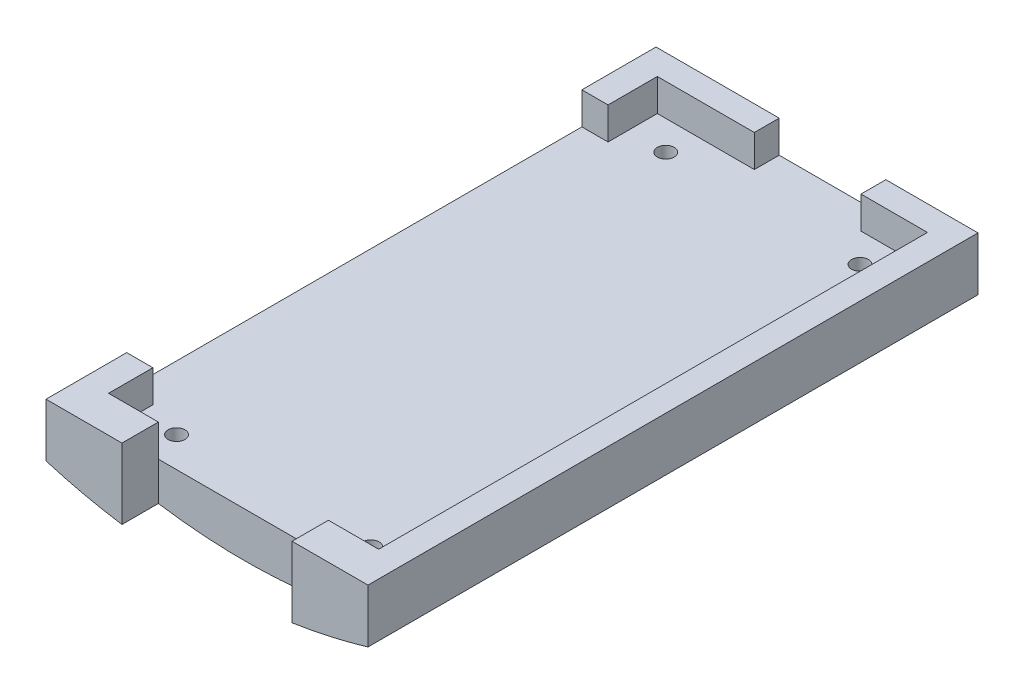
from build123d import *

# Parameters (mm, degrees)
SKETCH5_R            = 66.802
BOSS_EXTRUDE2_DEPTH  = 72.39
SKETCH6_W            = 47.755650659
SKETCH6_H            = 166.539429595
CUT_EXTRUDE2_DEPTH   = 76.2
SKETCH7_W            = 47.697642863
SKETCH7_H            = 210.531369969
CUT_EXTRUDE6_DEPTH   = 76.2
SKETCH8_W            = 84.02184285
SKETCH8_H            = 124.46
CUT_EXTRUDE7_DEPTH   = 76.2
SKETCH16_W           = 20.181173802
SKETCH16_H           = 36.504168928
CUT_EXTRUDE11_DEPTH  = 4.318
SKETCH17_W           = 32.054478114
SKETCH17_H           = 66.16676335
CUT_EXTRUDE12_DEPTH  = 3.81
SKETCH19_W           = 32.004
SKETCH19_H           = 2.032
CUT_EXTRUDE17_DEPTH  = 76.065621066
SKETCH25_W           = 12.65456728
SKETCH25_H           = 5.058539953
CUT_EXTRUDE16_DEPTH  = 3.81
SKETCH26_W           = 3.106077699
SKETCH26_H           = 54.016283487
CUT_EXTRUDE21_DEPTH  = 3.81
SKETCH32_W           = 5.965656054
SKETCH32_H           = 3.81
BOSS_EXTRUDE9_DEPTH  = 3.0776164
SKETCH33_W           = 5.907648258
SKETCH33_H           = 3.81
BOSS_EXTRUDE10_DEPTH = 3.0776164
SKETCH34_W           = 2.032
SKETCH34_H           = 3.81
CUT_EXTRUDE22_DEPTH  = 0.050478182
SKETCH41_R           = 1.143
BOSS_EXTRUDE14_DEPTH = 10.16
SKETCH42_R           = 1.143
BOSS_EXTRUDE16_DEPTH = 10.16
SKETCH43_R           = 1.143
BOSS_EXTRUDE17_DEPTH = 10.16
SKETCH44_R           = 1.143
BOSS_EXTRUDE18_DEPTH = 10.16
CUT_EXTRUDE23_DEPTH  = 4
SKETCH47_R           = 1
CUT_EXTRUDE24_DEPTH  = 76.562037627
CUT_EXTRUDE25_DEPTH  = 4
SKETCH49_R           = 1
CUT_EXTRUDE26_DEPTH  = 76.562037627
CUT_EXTRUDE27_DEPTH  = 4
CUT_EXTRUDE28_DEPTH  = 4
SKETCH53_R           = 1
CUT_EXTRUDE29_DEPTH  = 76.432145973
SKETCH54_R           = 1
CUT_EXTRUDE30_DEPTH  = 76.432145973
SKETCH55_W           = 32.054478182
SKETCH55_H           = 65.12114695
CUT_EXTRUDE31_DEPTH  = 3.81


with BuildPart() as part:
    # Sketch5 → Boss-Extrude2 (new body)
    with BuildSketch(Plane.XY):
        with Locations((0, 66.802)):
            Circle(SKETCH5_R)
    extrude(amount=BOSS_EXTRUDE2_DEPTH)

    # Sketch6 → Cut-Extrude2 (cut)
    with BuildSketch(Plane(origin=(0, 0, 0), x_dir=(-1, 0, 0), z_dir=(0, 0, -1))):
        with Locations((-42.953134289, 83.269714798)):
            Rectangle(SKETCH6_W, SKETCH6_H)
    extrude(amount=-CUT_EXTRUDE2_DEPTH, mode=Mode.SUBTRACT)

    # Sketch7 → Cut-Extrude6 (cut)
    with BuildSketch(Plane(origin=(0, 0, 0), x_dir=(-1, 0, 0), z_dir=(0, 0, -1))):
        with Locations((42.982138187, 105.265684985)):
            Rectangle(SKETCH7_W, SKETCH7_H)
    extrude(amount=-CUT_EXTRUDE6_DEPTH, mode=Mode.SUBTRACT)

    # Sketch8 → Cut-Extrude7 (cut)
    with BuildSketch(Plane(origin=(0, 0, 0), x_dir=(-1, 0, 0), z_dir=(0, 0, -1))):
        with Locations((9.699409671, 71.374)):
            Rectangle(SKETCH8_W, SKETCH8_H)
    extrude(amount=-CUT_EXTRUDE7_DEPTH, mode=Mode.SUBTRACT)

    # Sketch16 → Cut-Extrude11 (cut)
    with BuildSketch(Plane.XY.offset(72.39)):
        with Locations((-0.029003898, 9.435791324)):
            Rectangle(SKETCH16_W, SKETCH16_H)
    extrude(amount=-CUT_EXTRUDE11_DEPTH, mode=Mode.SUBTRACT)

    # Sketch17 → Cut-Extrude12 (cut)
    with BuildSketch(Plane(origin=(0, 9.144, 0), x_dir=(1, 0, 0), z_dir=(0, 1, 0))):
        with Locations((0, -38.066241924)):
            Rectangle(SKETCH17_W, SKETCH17_H)
    extrude(amount=-CUT_EXTRUDE12_DEPTH, mode=Mode.SUBTRACT)

    # Sketch19 → Cut-Extrude17 (cut, through all)
    with BuildSketch(Plane(origin=(0, 5.334, 0), x_dir=(1, 0, 0), z_dir=(0, 1, 0))):
        with Locations((0.025239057, -3.966860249)):
            Rectangle(SKETCH19_W, SKETCH19_H)
    extrude(amount=CUT_EXTRUDE17_DEPTH, mode=Mode.SUBTRACT)

    # Sketch25 → Cut-Extrude16 (cut)
    with BuildSketch(Plane(origin=(0, 9.144, 0), x_dir=(1, 0, 0), z_dir=(0, 1, 0))):
        with Locations((1.812699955, -1.12851864)):
            Rectangle(SKETCH25_W, SKETCH25_H)
    extrude(amount=-CUT_EXTRUDE16_DEPTH, mode=Mode.SUBTRACT)

    # Sketch26 → Cut-Extrude21 (cut)
    with BuildSketch(Plane(origin=(0, 9.144, 0), x_dir=(1, 0, 0), z_dir=(0, 1, 0))):
        with Locations((-17.580277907, -35.806583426)):
            Rectangle(SKETCH26_W, SKETCH26_H)
    extrude(amount=-CUT_EXTRUDE21_DEPTH, mode=Mode.SUBTRACT)

    # Sketch32 → Boss-Extrude9 (add)
    with BuildSketch(Plane(origin=(0, 0, 71.149623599), x_dir=(-1, 0, 0), z_dir=(0, 0, -1))):
        with Locations((-13.04441103, 7.239)):
            Rectangle(SKETCH32_W, SKETCH32_H)
    extrude(amount=BOSS_EXTRUDE9_DEPTH)

    # Sketch33 → Boss-Extrude10 (add)
    with BuildSketch(Plane(origin=(0, 0, 71.149623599), x_dir=(-1, 0, 0), z_dir=(0, 0, -1))):
        with Locations((13.073414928, 7.239)):
            Rectangle(SKETCH33_W, SKETCH33_H)
    extrude(amount=BOSS_EXTRUDE10_DEPTH)

    # Sketch34 → Cut-Extrude22 (cut)
    with BuildSketch(Plane(origin=(-15.976760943, 0, 0), x_dir=(0, 0, -1), z_dir=(1, 0, 0))):
        with Locations((-3.966860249, 7.239)):
            Rectangle(SKETCH34_W, SKETCH34_H)
    extrude(amount=-CUT_EXTRUDE22_DEPTH, mode=Mode.SUBTRACT)

    # Sketch41 → Boss-Extrude14 (add)
    with BuildSketch(Plane(origin=(0, 9.144, 0), x_dir=(1, 0, 0), z_dir=(0, 1, 0))):
        with Locations(Location((11.49599976, -6.4258825, 0), (0, 0, 270))):
            Circle(SKETCH41_R)
    extrude(amount=-BOSS_EXTRUDE14_DEPTH)

    # Sketch42 → Boss-Extrude16 (add)
    with BuildSketch(Plane(origin=(0, 9.144, 0), x_dir=(1, 0, 0), z_dir=(0, 1, 0))):
        with Locations(Location((-11.554007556, -6.4258698, 0), (0, 0, 270))):
            Circle(SKETCH42_R)
    extrude(amount=-BOSS_EXTRUDE16_DEPTH)

    # Sketch43 → Boss-Extrude17 (add)
    with BuildSketch(Plane(origin=(0, 9.144, 0), x_dir=(1, 0, 0), z_dir=(0, 1, 0))):
        with Locations(Location((11.49599976, -64.47586038, 0), (0, 0, 270))):
            Circle(SKETCH43_R)
    extrude(amount=-BOSS_EXTRUDE17_DEPTH)

    # Sketch44 → Boss-Extrude18 (add)
    with BuildSketch(Plane(origin=(0, 9.144, 0), x_dir=(1, 0, 0), z_dir=(0, 1, 0))):
        with Locations(Location((-11.554007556, -64.47586038, 0), (0, 0, 270))):
            Circle(SKETCH44_R)
    extrude(amount=-BOSS_EXTRUDE18_DEPTH)

    # Sketch46 → Cut-Extrude23 (cut)
    with BuildSketch(Plane(origin=(0, -1.016, 0), x_dir=(-1, 0, 0), z_dir=(0, -1, 0))):
        Polygon((-11.49599976, -62.22419433), (-13.44599976, -63.350027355), (-13.44599976, -65.601693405), (-11.49599976, -66.72752643), (-9.54599976, -65.601693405), (-9.54599976, -63.350027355), align=None)
    extrude(amount=-CUT_EXTRUDE23_DEPTH, mode=Mode.SUBTRACT)

    # Sketch47 → Cut-Extrude24 (cut, through all)
    with BuildSketch(Plane(origin=(0, 9.144, 0), x_dir=(1, 0, 0), z_dir=(0, 1, 0))):
        with Locations(Location((11.49599976, -64.47586038, 0), (0, 0, 270))):
            Circle(SKETCH47_R)
    extrude(amount=-CUT_EXTRUDE24_DEPTH, mode=Mode.SUBTRACT)

    # Sketch48 → Cut-Extrude25 (cut)
    with BuildSketch(Plane.XZ.offset(1.016)):
        Polygon((-11.554007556, 62.22419433), (-9.604007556, 63.350027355), (-9.604007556, 65.601693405), (-11.554007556, 66.72752643), (-13.504007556, 65.601693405), (-13.504007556, 63.350027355), align=None)
    extrude(amount=-CUT_EXTRUDE25_DEPTH, mode=Mode.SUBTRACT)

    # Sketch49 → Cut-Extrude26 (cut, through all)
    with BuildSketch(Plane(origin=(0, 9.144, 0), x_dir=(1, 0, 0), z_dir=(0, 1, 0))):
        with Locations(Location((-11.554007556, -64.47586038, 0), (0, 0, 270))):
            Circle(SKETCH49_R)
    extrude(amount=-CUT_EXTRUDE26_DEPTH, mode=Mode.SUBTRACT)

    # Sketch50 → Cut-Extrude27 (cut)
    with BuildSketch(Plane.XZ.offset(1.016)):
        Polygon((-11.554007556, 4.17420375), (-9.604007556, 5.300036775), (-9.604007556, 7.551702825), (-11.554007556, 8.67753585), (-13.504007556, 7.551702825), (-13.504007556, 5.300036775), align=None)
    extrude(amount=-CUT_EXTRUDE27_DEPTH, mode=Mode.SUBTRACT)

    # Sketch52 → Cut-Extrude28 (cut)
    with BuildSketch(Plane.XZ.offset(1.016)):
        Polygon((11.49599976, 4.17421645), (13.44599976, 5.300049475), (13.44599976, 7.551715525), (11.49599976, 8.67754855), (9.54599976, 7.551715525), (9.54599976, 5.300049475), align=None)
    extrude(amount=-CUT_EXTRUDE28_DEPTH, mode=Mode.SUBTRACT)

    # Sketch53 → Cut-Extrude29 (cut, through all)
    with BuildSketch(Plane(origin=(0, 9.144, 0), x_dir=(1, 0, 0), z_dir=(0, 1, 0))):
        with Locations(Location((11.49599976, -6.4258825, 0), (0, 0, 270))):
            Circle(SKETCH53_R)
    extrude(amount=-CUT_EXTRUDE29_DEPTH, mode=Mode.SUBTRACT)

    # Sketch54 → Cut-Extrude30 (cut, through all)
    with BuildSketch(Plane(origin=(0, 9.144, 0), x_dir=(1, 0, 0), z_dir=(0, 1, 0))):
        with Locations(Location((-11.554007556, -6.4258698, 0), (0, 0, 270))):
            Circle(SKETCH54_R)
    extrude(amount=-CUT_EXTRUDE30_DEPTH, mode=Mode.SUBTRACT)

    # Sketch55 → Cut-Extrude31 (cut)
    with BuildSketch(Plane(origin=(0, 9.144, 0), x_dir=(1, 0, 0), z_dir=(0, 1, 0))):
        with Locations((-3.4e-08, -35.511433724)):
            Rectangle(SKETCH55_W, SKETCH55_H)
    extrude(amount=-CUT_EXTRUDE31_DEPTH, mode=Mode.SUBTRACT)


solid = part.part
